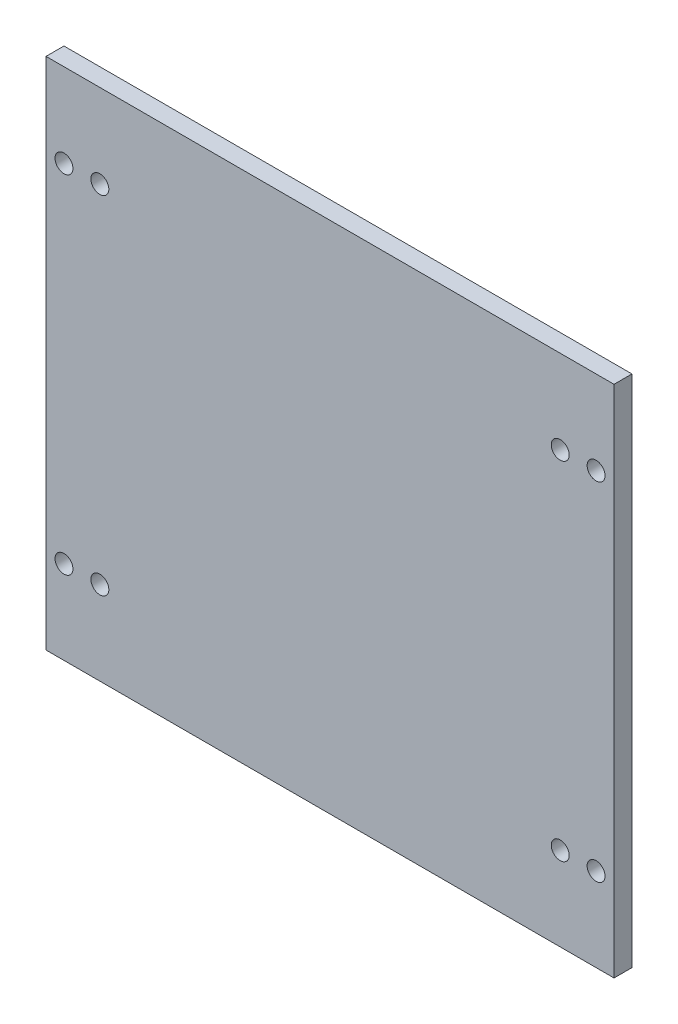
from build123d import *

# Parameters (mm, degrees)
ESQUISSE1_W      = 95
ESQUISSE1_H      = 86
ESQUISSE1_R      = 1.5
EXTRUSION1_DEPTH = 3


with BuildPart() as part:
    # Esquisse1 → Extrusion1 (new body)
    with BuildSketch(Plane.XY):
        with Locations((47.5, 43)):
            Rectangle(ESQUISSE1_W, ESQUISSE1_H)
        with Locations((3, 14)):
            Circle(ESQUISSE1_R, mode=Mode.SUBTRACT)
        with Locations((9, 14)):
            Circle(ESQUISSE1_R, mode=Mode.SUBTRACT)
        with Locations(Location((9, 72, 0), (0, 0, 180))):
            Circle(ESQUISSE1_R, mode=Mode.SUBTRACT)
        with Locations(Location((3, 72, 0), (0, 0, 180))):
            Circle(ESQUISSE1_R, mode=Mode.SUBTRACT)
        with Locations((92, 72)):
            Circle(ESQUISSE1_R, mode=Mode.SUBTRACT)
        with Locations((86, 72)):
            Circle(ESQUISSE1_R, mode=Mode.SUBTRACT)
        with Locations(Location((92, 14, 0), (0, 0, 180))):
            Circle(ESQUISSE1_R, mode=Mode.SUBTRACT)
        with Locations(Location((86, 14, 0), (0, 0, 180))):
            Circle(ESQUISSE1_R, mode=Mode.SUBTRACT)
    extrude(amount=EXTRUSION1_DEPTH)


solid = part.part
